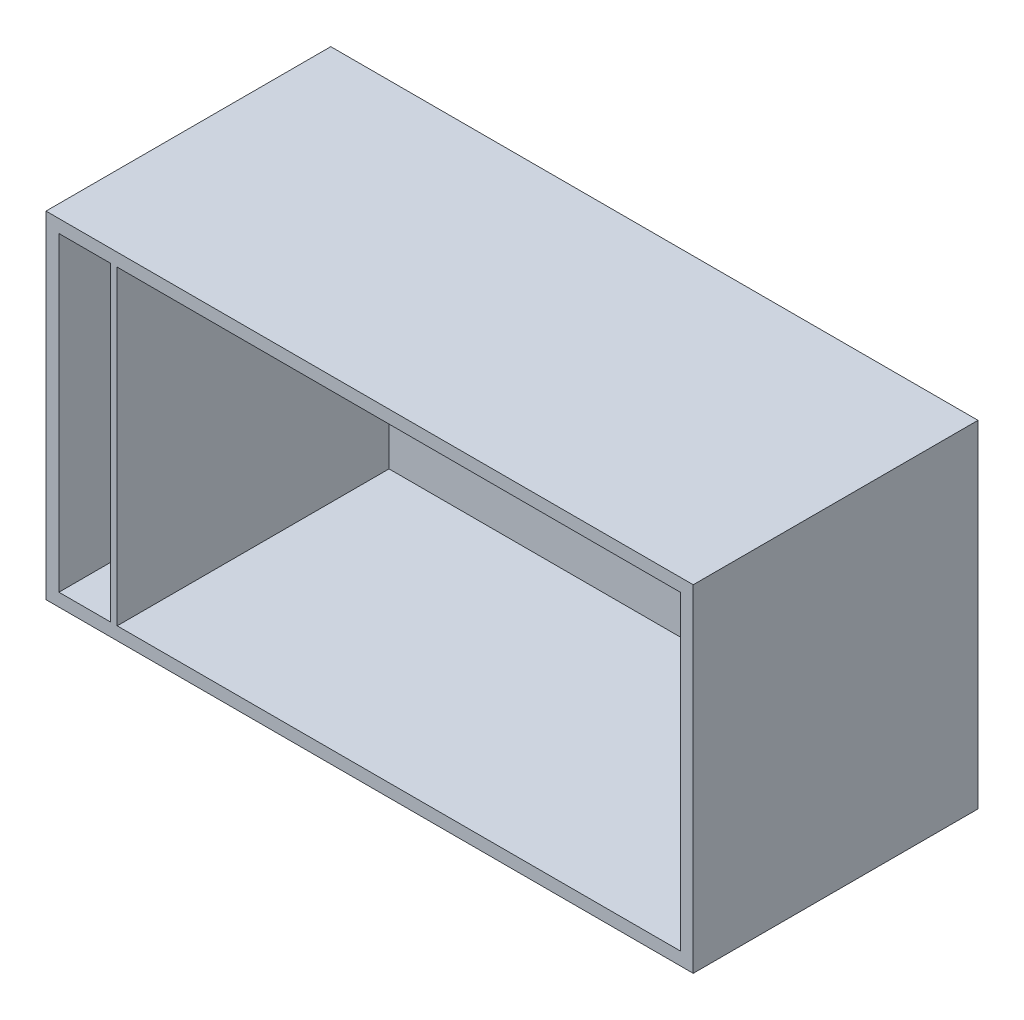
from build123d import *

# Parameters (mm, degrees)
SKETCH1_W      = 635
SKETCH1_H      = 330.2
SKETCH1_W_2    = 609.6
SKETCH1_H_2    = 304.8
EXTRUDE1_DEPTH = 266.7
SKETCH2_W      = 635
SKETCH2_H      = 330.2
EXTRUDE2_DEPTH = 12.7
SKETCH3_W      = 6.35
SKETCH3_H      = 304.8
EXTRUDE3_DEPTH = 266.7


with BuildPart() as part:
    # Sketch1 → Extrude1 (new body)
    with BuildSketch(Plane.XY):
        with Locations((304.8, 152.4)):
            Rectangle(SKETCH1_W, SKETCH1_H)
        with Locations((304.8, 152.4)):
            Rectangle(SKETCH1_W_2, SKETCH1_H_2, mode=Mode.SUBTRACT)
    extrude(amount=EXTRUDE1_DEPTH)

    # Sketch2 → Extrude2 (add)
    with BuildSketch(Plane(origin=(0, 0, 0), x_dir=(-1, 0, 0), z_dir=(0, 0, -1))):
        with Locations((-304.8, 152.4)):
            Rectangle(SKETCH2_W, SKETCH2_H)
    extrude(amount=EXTRUDE2_DEPTH)

    # Sketch3 → Extrude3 (add)
    with BuildSketch(Plane.XY):
        with Locations((53.975, 152.4)):
            Rectangle(SKETCH3_W, SKETCH3_H)
    extrude(amount=EXTRUDE3_DEPTH)


solid = part.part
